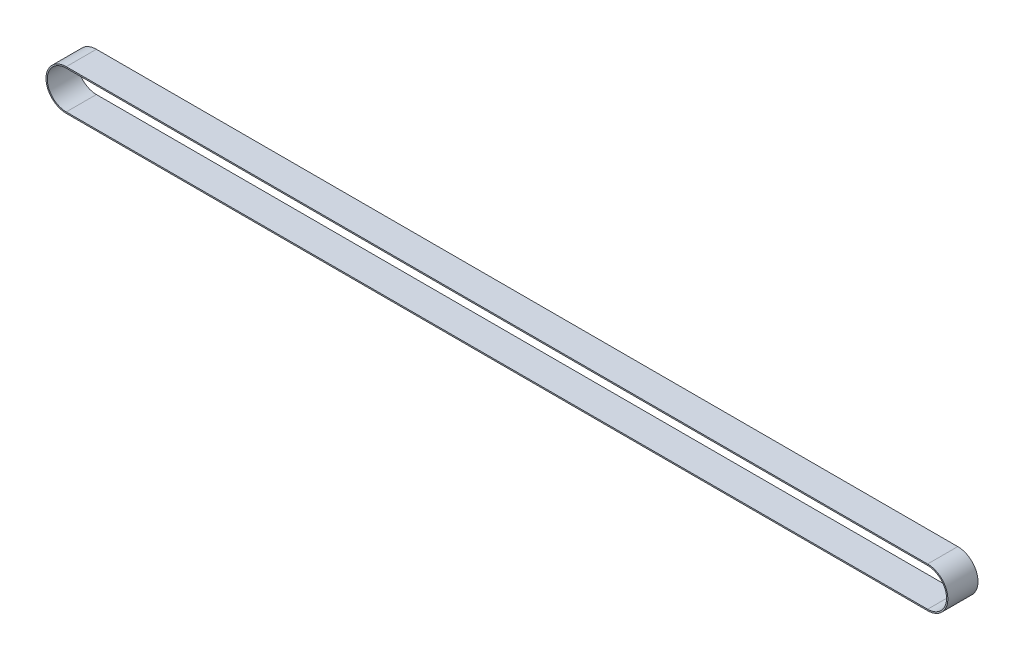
ISO-10303-21;
HEADER;
FILE_DESCRIPTION(('STEP AP214'),'2;1');
FILE_NAME('part.step','',(''),(''),'','','');
FILE_SCHEMA(('AUTOMOTIVE_DESIGN { 1 0 10303 214 1 1 1 1 }'));
ENDSEC;
DATA;
#1=APPLICATION_CONTEXT('core data for automotive mechanical design processes');
#2=APPLICATION_PROTOCOL_DEFINITION('international standard','automotive_design',2000,#1);
#3=PRODUCT_CONTEXT('',#1,'mechanical');
#4=PRODUCT('Part','Part','',(#3));
#5=PRODUCT_RELATED_PRODUCT_CATEGORY('part','',(#4));
#6=PRODUCT_DEFINITION_FORMATION('','',#4);
#7=PRODUCT_DEFINITION_CONTEXT('part definition',#1,'design');
#8=PRODUCT_DEFINITION('design','',#6,#7);
#9=PRODUCT_DEFINITION_SHAPE('','',#8);
#10=(LENGTH_UNIT() NAMED_UNIT(*) SI_UNIT(.MILLI.,.METRE.));
#11=(NAMED_UNIT(*) PLANE_ANGLE_UNIT() SI_UNIT($,.RADIAN.));
#12=(NAMED_UNIT(*) SI_UNIT($,.STERADIAN.) SOLID_ANGLE_UNIT());
#13=UNCERTAINTY_MEASURE_WITH_UNIT(LENGTH_MEASURE(1.E-05),#10,'distance_accuracy_value','');
#14=(GEOMETRIC_REPRESENTATION_CONTEXT(3) GLOBAL_UNCERTAINTY_ASSIGNED_CONTEXT((#13)) GLOBAL_UNIT_ASSIGNED_CONTEXT((#10,
#11,#12)) REPRESENTATION_CONTEXT('',''));
#15=CARTESIAN_POINT('',(0.,0.,0.));
#16=DIRECTION('',(0.,0.,1.));
#17=DIRECTION('',(1.,0.,0.));
#18=AXIS2_PLACEMENT_3D('',#15,#16,#17);
#19=CARTESIAN_POINT('',(929.500000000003,135.999999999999,17.5));
#20=DIRECTION('',(0.,0.,-1.));
#21=DIRECTION('',(-1.,0.,0.));
#22=AXIS2_PLACEMENT_3D('',#19,#20,#21);
#23=PLANE('',#22);
#24=CARTESIAN_POINT('',(929.500000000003,135.999999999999,17.5));
#25=DIRECTION('',(0.,0.,-1.));
#26=DIRECTION('',(-1.,0.,0.));
#27=AXIS2_PLACEMENT_3D('',#24,#25,#26);
#28=CIRCLE('',#27,23.5);
#29=CARTESIAN_POINT('',(929.500000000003,112.499999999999,17.5));
#30=VERTEX_POINT('',#29);
#31=CARTESIAN_POINT('',(929.500000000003,159.499999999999,17.5));
#32=VERTEX_POINT('',#31);
#33=EDGE_CURVE('E170',#30,#32,#28,.F.);
#34=ORIENTED_EDGE('',*,*,#33,.T.);
#35=DIRECTION('',(-1.,0.,0.));
#36=VECTOR('',#35,1.);
#37=CARTESIAN_POINT('',(929.500000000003,159.499999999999,17.5));
#38=LINE('',#37,#36);
#39=CARTESIAN_POINT('',(-70.4999999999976,159.500000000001,17.5));
#40=VERTEX_POINT('',#39);
#41=EDGE_CURVE('E173',#32,#40,#38,.T.);
#42=ORIENTED_EDGE('',*,*,#41,.T.);
#43=CARTESIAN_POINT('',(-70.4999999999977,136.000000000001,17.5));
#44=DIRECTION('',(0.,0.,-1.));
#45=DIRECTION('',(-1.,0.,0.));
#46=AXIS2_PLACEMENT_3D('',#43,#44,#45);
#47=CIRCLE('',#46,23.5);
#48=CARTESIAN_POINT('',(-70.4999999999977,112.500000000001,17.5));
#49=VERTEX_POINT('',#48);
#50=EDGE_CURVE('E176',#40,#49,#47,.F.);
#51=ORIENTED_EDGE('',*,*,#50,.T.);
#52=DIRECTION('',(1.,0.,0.));
#53=VECTOR('',#52,1.);
#54=CARTESIAN_POINT('',(929.500000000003,112.499999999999,17.5));
#55=LINE('',#54,#53);
#56=EDGE_CURVE('E178',#49,#30,#55,.T.);
#57=ORIENTED_EDGE('',*,*,#56,.T.);
#58=EDGE_LOOP('',(#34,#42,#51,#57));
#59=FACE_BOUND('',#58,.T.);
#60=CARTESIAN_POINT('',(929.500000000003,135.999999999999,17.5));
#61=DIRECTION('',(0.,0.,1.));
#62=DIRECTION('',(-1.,0.,0.));
#63=AXIS2_PLACEMENT_3D('',#60,#61,#62);
#64=CIRCLE('',#63,22.);
#65=CARTESIAN_POINT('',(929.500000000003,113.999999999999,17.5));
#66=VERTEX_POINT('',#65);
#67=CARTESIAN_POINT('',(929.500000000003,157.999999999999,17.5));
#68=VERTEX_POINT('',#67);
#69=EDGE_CURVE('E132',#66,#68,#64,.T.);
#70=ORIENTED_EDGE('',*,*,#69,.F.);
#71=DIRECTION('',(1.,0.,0.));
#72=VECTOR('',#71,1.);
#73=CARTESIAN_POINT('',(929.500000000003,113.999999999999,17.5));
#74=LINE('',#73,#72);
#75=CARTESIAN_POINT('',(-70.4999999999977,114.000000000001,17.5));
#76=VERTEX_POINT('',#75);
#77=EDGE_CURVE('E156',#76,#66,#74,.T.);
#78=ORIENTED_EDGE('',*,*,#77,.F.);
#79=CARTESIAN_POINT('',(-70.4999999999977,136.000000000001,17.5));
#80=DIRECTION('',(0.,0.,1.));
#81=DIRECTION('',(-1.,0.,0.));
#82=AXIS2_PLACEMENT_3D('',#79,#80,#81);
#83=CIRCLE('',#82,22.);
#84=CARTESIAN_POINT('',(-70.4999999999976,158.000000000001,17.5));
#85=VERTEX_POINT('',#84);
#86=EDGE_CURVE('E152',#85,#76,#83,.T.);
#87=ORIENTED_EDGE('',*,*,#86,.F.);
#88=DIRECTION('',(-1.,0.,0.));
#89=VECTOR('',#88,1.);
#90=CARTESIAN_POINT('',(-70.4999999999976,158.000000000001,17.5));
#91=LINE('',#90,#89);
#92=EDGE_CURVE('E140',#68,#85,#91,.T.);
#93=ORIENTED_EDGE('',*,*,#92,.F.);
#94=EDGE_LOOP('',(#70,#78,#87,#93));
#95=FACE_BOUND('',#94,.T.);
#96=ADVANCED_FACE('F67',(#59,#95),#23,.F.);
#97=CARTESIAN_POINT('',(929.500000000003,135.999999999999,-17.5));
#98=DIRECTION('',(0.,0.,-1.));
#99=DIRECTION('',(-1.,0.,0.));
#100=AXIS2_PLACEMENT_3D('',#97,#98,#99);
#101=PLANE('',#100);
#102=CARTESIAN_POINT('',(929.500000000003,135.999999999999,-17.5));
#103=DIRECTION('',(0.,0.,-1.));
#104=DIRECTION('',(-1.,0.,0.));
#105=AXIS2_PLACEMENT_3D('',#102,#103,#104);
#106=CIRCLE('',#105,23.5);
#107=CARTESIAN_POINT('',(929.500000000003,112.499999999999,-17.5));
#108=VERTEX_POINT('',#107);
#109=CARTESIAN_POINT('',(929.500000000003,159.499999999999,-17.5));
#110=VERTEX_POINT('',#109);
#111=EDGE_CURVE('E148',#108,#110,#106,.F.);
#112=ORIENTED_EDGE('',*,*,#111,.F.);
#113=DIRECTION('',(1.,0.,0.));
#114=VECTOR('',#113,1.);
#115=CARTESIAN_POINT('',(929.500000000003,112.499999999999,-17.5));
#116=LINE('',#115,#114);
#117=CARTESIAN_POINT('',(-70.4999999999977,112.500000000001,-17.5));
#118=VERTEX_POINT('',#117);
#119=EDGE_CURVE('E174',#118,#108,#116,.T.);
#120=ORIENTED_EDGE('',*,*,#119,.F.);
#121=CARTESIAN_POINT('',(-70.4999999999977,136.000000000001,-17.5));
#122=DIRECTION('',(0.,0.,-1.));
#123=DIRECTION('',(-1.,0.,0.));
#124=AXIS2_PLACEMENT_3D('',#121,#122,#123);
#125=CIRCLE('',#124,23.5);
#126=CARTESIAN_POINT('',(-70.4999999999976,159.500000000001,-17.5));
#127=VERTEX_POINT('',#126);
#128=EDGE_CURVE('E185',#127,#118,#125,.F.);
#129=ORIENTED_EDGE('',*,*,#128,.F.);
#130=DIRECTION('',(-1.,0.,0.));
#131=VECTOR('',#130,1.);
#132=CARTESIAN_POINT('',(929.500000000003,159.499999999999,-17.5));
#133=LINE('',#132,#131);
#134=EDGE_CURVE('E183',#110,#127,#133,.T.);
#135=ORIENTED_EDGE('',*,*,#134,.F.);
#136=EDGE_LOOP('',(#112,#120,#129,#135));
#137=FACE_BOUND('',#136,.T.);
#138=DIRECTION('',(1.,0.,0.));
#139=VECTOR('',#138,1.);
#140=CARTESIAN_POINT('',(929.500000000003,113.999999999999,-17.5));
#141=LINE('',#140,#139);
#142=CARTESIAN_POINT('',(-70.4999999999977,114.000000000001,-17.5));
#143=VERTEX_POINT('',#142);
#144=CARTESIAN_POINT('',(929.500000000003,113.999999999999,-17.5));
#145=VERTEX_POINT('',#144);
#146=EDGE_CURVE('E141',#143,#145,#141,.T.);
#147=ORIENTED_EDGE('',*,*,#146,.T.);
#148=CARTESIAN_POINT('',(929.500000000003,135.999999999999,-17.5));
#149=DIRECTION('',(0.,0.,1.));
#150=DIRECTION('',(-1.,0.,0.));
#151=AXIS2_PLACEMENT_3D('',#148,#149,#150);
#152=CIRCLE('',#151,22.);
#153=CARTESIAN_POINT('',(929.500000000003,157.999999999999,-17.5));
#154=VERTEX_POINT('',#153);
#155=EDGE_CURVE('E90',#145,#154,#152,.T.);
#156=ORIENTED_EDGE('',*,*,#155,.T.);
#157=DIRECTION('',(-1.,0.,0.));
#158=VECTOR('',#157,1.);
#159=CARTESIAN_POINT('',(-70.4999999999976,158.000000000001,-17.5));
#160=LINE('',#159,#158);
#161=CARTESIAN_POINT('',(-70.4999999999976,158.000000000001,-17.5));
#162=VERTEX_POINT('',#161);
#163=EDGE_CURVE('E147',#154,#162,#160,.T.);
#164=ORIENTED_EDGE('',*,*,#163,.T.);
#165=CARTESIAN_POINT('',(-70.4999999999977,136.000000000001,-17.5));
#166=DIRECTION('',(0.,0.,1.));
#167=DIRECTION('',(-1.,0.,0.));
#168=AXIS2_PLACEMENT_3D('',#165,#166,#167);
#169=CIRCLE('',#168,22.);
#170=EDGE_CURVE('E162',#162,#143,#169,.T.);
#171=ORIENTED_EDGE('',*,*,#170,.T.);
#172=EDGE_LOOP('',(#147,#156,#164,#171));
#173=FACE_BOUND('',#172,.T.);
#174=ADVANCED_FACE('F203',(#137,#173),#101,.T.);
#175=CARTESIAN_POINT('',(929.500000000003,135.999999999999,17.5));
#176=DIRECTION('',(0.,0.,-1.));
#177=DIRECTION('',(-1.,0.,0.));
#178=AXIS2_PLACEMENT_3D('',#175,#176,#177);
#179=CYLINDRICAL_SURFACE('',#178,23.5);
#180=ORIENTED_EDGE('',*,*,#111,.T.);
#181=DIRECTION('',(0.,0.,-1.));
#182=VECTOR('',#181,1.);
#183=CARTESIAN_POINT('',(929.500000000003,159.499999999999,17.5));
#184=LINE('',#183,#182);
#185=EDGE_CURVE('E12',#32,#110,#184,.T.);
#186=ORIENTED_EDGE('',*,*,#185,.F.);
#187=ORIENTED_EDGE('',*,*,#33,.F.);
#188=DIRECTION('',(0.,0.,-1.));
#189=VECTOR('',#188,1.);
#190=CARTESIAN_POINT('',(929.500000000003,112.499999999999,17.5));
#191=LINE('',#190,#189);
#192=EDGE_CURVE('E180',#30,#108,#191,.T.);
#193=ORIENTED_EDGE('',*,*,#192,.T.);
#194=EDGE_LOOP('',(#180,#186,#187,#193));
#195=FACE_BOUND('',#194,.T.);
#196=ADVANCED_FACE('F69',(#195),#179,.T.);
#197=CARTESIAN_POINT('',(929.500000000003,159.499999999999,17.5));
#198=DIRECTION('',(0.,-1.,0.));
#199=DIRECTION('',(1.,0.,0.));
#200=AXIS2_PLACEMENT_3D('',#197,#198,#199);
#201=PLANE('',#200);
#202=ORIENTED_EDGE('',*,*,#134,.T.);
#203=DIRECTION('',(0.,0.,-1.));
#204=VECTOR('',#203,1.);
#205=CARTESIAN_POINT('',(-70.4999999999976,159.500000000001,17.5));
#206=LINE('',#205,#204);
#207=EDGE_CURVE('E75',#40,#127,#206,.T.);
#208=ORIENTED_EDGE('',*,*,#207,.F.);
#209=ORIENTED_EDGE('',*,*,#41,.F.);
#210=ORIENTED_EDGE('',*,*,#185,.T.);
#211=EDGE_LOOP('',(#202,#208,#209,#210));
#212=FACE_BOUND('',#211,.T.);
#213=ADVANCED_FACE('F213',(#212),#201,.F.);
#214=CARTESIAN_POINT('',(-70.4999999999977,136.000000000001,17.5));
#215=DIRECTION('',(0.,0.,-1.));
#216=DIRECTION('',(-1.,0.,0.));
#217=AXIS2_PLACEMENT_3D('',#214,#215,#216);
#218=CYLINDRICAL_SURFACE('',#217,23.5);
#219=ORIENTED_EDGE('',*,*,#128,.T.);
#220=DIRECTION('',(0.,0.,-1.));
#221=VECTOR('',#220,1.);
#222=CARTESIAN_POINT('',(-70.4999999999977,112.500000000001,17.5));
#223=LINE('',#222,#221);
#224=EDGE_CURVE('E190',#49,#118,#223,.T.);
#225=ORIENTED_EDGE('',*,*,#224,.F.);
#226=ORIENTED_EDGE('',*,*,#50,.F.);
#227=ORIENTED_EDGE('',*,*,#207,.T.);
#228=EDGE_LOOP('',(#219,#225,#226,#227));
#229=FACE_BOUND('',#228,.T.);
#230=ADVANCED_FACE('F197',(#229),#218,.T.);
#231=CARTESIAN_POINT('',(929.500000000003,112.499999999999,17.5));
#232=DIRECTION('',(0.,1.,0.));
#233=DIRECTION('',(-1.,0.,0.));
#234=AXIS2_PLACEMENT_3D('',#231,#232,#233);
#235=PLANE('',#234);
#236=ORIENTED_EDGE('',*,*,#119,.T.);
#237=ORIENTED_EDGE('',*,*,#192,.F.);
#238=ORIENTED_EDGE('',*,*,#56,.F.);
#239=ORIENTED_EDGE('',*,*,#224,.T.);
#240=EDGE_LOOP('',(#236,#237,#238,#239));
#241=FACE_BOUND('',#240,.T.);
#242=ADVANCED_FACE('F207',(#241),#235,.F.);
#243=CARTESIAN_POINT('',(929.500000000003,135.999999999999,17.5));
#244=DIRECTION('',(0.,0.,-1.));
#245=DIRECTION('',(-1.,0.,0.));
#246=AXIS2_PLACEMENT_3D('',#243,#244,#245);
#247=CYLINDRICAL_SURFACE('',#246,22.);
#248=ORIENTED_EDGE('',*,*,#155,.F.);
#249=DIRECTION('',(0.,0.,-1.));
#250=VECTOR('',#249,1.);
#251=CARTESIAN_POINT('',(929.500000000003,113.999999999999,17.5));
#252=LINE('',#251,#250);
#253=EDGE_CURVE('E136',#66,#145,#252,.T.);
#254=ORIENTED_EDGE('',*,*,#253,.F.);
#255=ORIENTED_EDGE('',*,*,#69,.T.);
#256=DIRECTION('',(0.,0.,-1.));
#257=VECTOR('',#256,1.);
#258=CARTESIAN_POINT('',(929.500000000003,157.999999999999,17.5));
#259=LINE('',#258,#257);
#260=EDGE_CURVE('E135',#68,#154,#259,.T.);
#261=ORIENTED_EDGE('',*,*,#260,.T.);
#262=EDGE_LOOP('',(#248,#254,#255,#261));
#263=FACE_BOUND('',#262,.T.);
#264=ADVANCED_FACE('F134',(#263),#247,.F.);
#265=CARTESIAN_POINT('',(-70.4999999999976,158.000000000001,17.5));
#266=DIRECTION('',(0.,-1.,0.));
#267=DIRECTION('',(1.,0.,0.));
#268=AXIS2_PLACEMENT_3D('',#265,#266,#267);
#269=PLANE('',#268);
#270=ORIENTED_EDGE('',*,*,#163,.F.);
#271=ORIENTED_EDGE('',*,*,#260,.F.);
#272=ORIENTED_EDGE('',*,*,#92,.T.);
#273=DIRECTION('',(0.,0.,-1.));
#274=VECTOR('',#273,1.);
#275=CARTESIAN_POINT('',(-70.4999999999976,158.000000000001,17.5));
#276=LINE('',#275,#274);
#277=EDGE_CURVE('E149',#85,#162,#276,.T.);
#278=ORIENTED_EDGE('',*,*,#277,.T.);
#279=EDGE_LOOP('',(#270,#271,#272,#278));
#280=FACE_BOUND('',#279,.T.);
#281=ADVANCED_FACE('F144',(#280),#269,.T.);
#282=CARTESIAN_POINT('',(-70.4999999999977,136.000000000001,17.5));
#283=DIRECTION('',(0.,0.,-1.));
#284=DIRECTION('',(-1.,0.,0.));
#285=AXIS2_PLACEMENT_3D('',#282,#283,#284);
#286=CYLINDRICAL_SURFACE('',#285,22.);
#287=ORIENTED_EDGE('',*,*,#170,.F.);
#288=ORIENTED_EDGE('',*,*,#277,.F.);
#289=ORIENTED_EDGE('',*,*,#86,.T.);
#290=DIRECTION('',(0.,0.,-1.));
#291=VECTOR('',#290,1.);
#292=CARTESIAN_POINT('',(-70.4999999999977,114.000000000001,17.5));
#293=LINE('',#292,#291);
#294=EDGE_CURVE('E82',#76,#143,#293,.T.);
#295=ORIENTED_EDGE('',*,*,#294,.T.);
#296=EDGE_LOOP('',(#287,#288,#289,#295));
#297=FACE_BOUND('',#296,.T.);
#298=ADVANCED_FACE('F236',(#297),#286,.F.);
#299=CARTESIAN_POINT('',(929.500000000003,113.999999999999,17.5));
#300=DIRECTION('',(0.,1.,0.));
#301=DIRECTION('',(-1.,0.,0.));
#302=AXIS2_PLACEMENT_3D('',#299,#300,#301);
#303=PLANE('',#302);
#304=ORIENTED_EDGE('',*,*,#146,.F.);
#305=ORIENTED_EDGE('',*,*,#294,.F.);
#306=ORIENTED_EDGE('',*,*,#77,.T.);
#307=ORIENTED_EDGE('',*,*,#253,.T.);
#308=EDGE_LOOP('',(#304,#305,#306,#307));
#309=FACE_BOUND('',#308,.T.);
#310=ADVANCED_FACE('F240',(#309),#303,.T.);
#311=CLOSED_SHELL('',(#96,#174,#196,#213,#230,#242,#264,#281,#298,#310));
#312=MANIFOLD_SOLID_BREP('B2',#311);
#313=ADVANCED_BREP_SHAPE_REPRESENTATION('',(#18,#312),#14);
#314=SHAPE_DEFINITION_REPRESENTATION(#9,#313);
ENDSEC;
END-ISO-10303-21;
